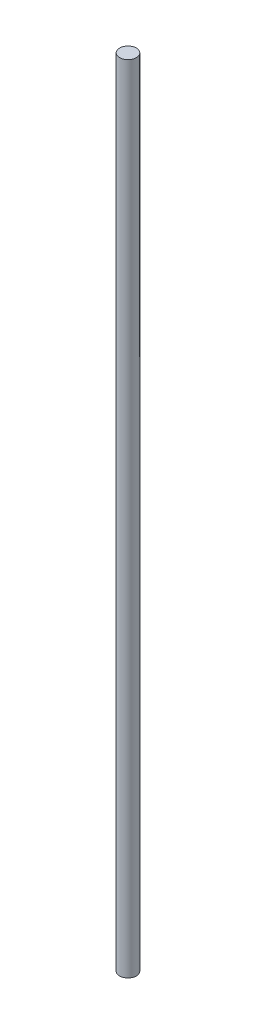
from build123d import *

# Parameters (mm, degrees)
SKETCH1_R           = 3.15
BOSS_EXTRUDE1_DEPTH = 300


with BuildPart() as part:
    # Sketch1 → Boss-Extrude1 (new body)
    with BuildSketch(Plane(origin=(0, 0, 0), x_dir=(1, 0, 0), z_dir=(0, 1, 0))):
        with Locations(Location((0, 0, 0), (0, 0, 270))):
            Circle(SKETCH1_R)
    extrude(amount=BOSS_EXTRUDE1_DEPTH)


solid = part.part
